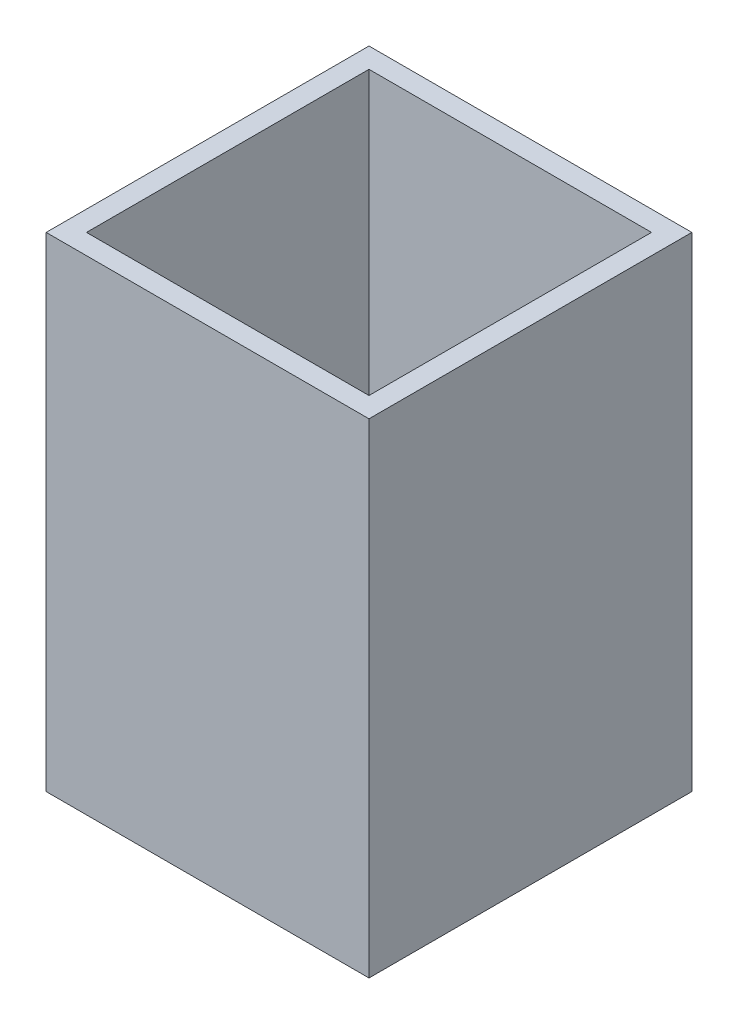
from build123d import *

# Parameters (mm, degrees)
SKETCH1_W           = 50.8
SKETCH1_H           = 50.8
SKETCH1_W_2         = 44.45
SKETCH1_H_2         = 44.45
BOSS_EXTRUDE1_DEPTH = 76.2


with BuildPart() as part:
    # Sketch1 → Boss-Extrude1 (new body)
    with BuildSketch(Plane(origin=(0, 76.2, 0), x_dir=(-1, 0, 0), z_dir=(0, 1, 0))):
        with Locations((-64.927548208, -1.837470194)):
            Rectangle(SKETCH1_W, SKETCH1_H)
        with Locations((-64.927548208, -1.837470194)):
            Rectangle(SKETCH1_W_2, SKETCH1_H_2, mode=Mode.SUBTRACT)
    extrude(amount=-BOSS_EXTRUDE1_DEPTH)


solid = part.part
